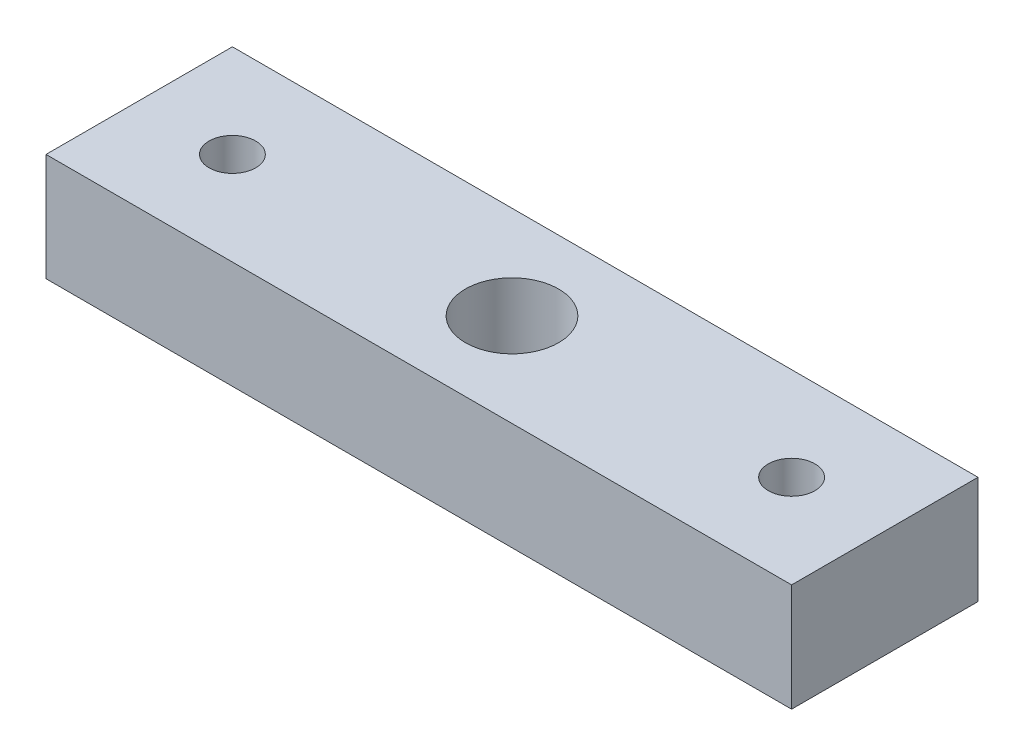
from build123d import *

# Parameters (mm, degrees)
SKETCH1_W                   = 406.4
SKETCH1_H                   = 101.6
SKETCH1_R                   = 12.7
SKETCH1_R_2                 = 25.4
BOSS_EXTRUDE1_DEPTH         = 58.684890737
F_1_4_20_TAPPED_HOLE1_D     = 5.1054
F_1_4_20_TAPPED_HOLE1_DEPTH = 31.75
F_1_4_20_TAPPED_HOLE1_TIP   = 1.533816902


with BuildPart() as part:
    # Sketch1 → Boss-Extrude1 (new body)
    with BuildSketch(Plane(origin=(0, 0, 0), x_dir=(1, 0, 0), z_dir=(0, 1, 0))):
        Rectangle(SKETCH1_W, SKETCH1_H)
        with Locations(Location((-152.4, 0, 0), (0, 0, 270))):
            Circle(SKETCH1_R, mode=Mode.SUBTRACT)
        with Locations(Location((152.4, 0, 0), (0, 0, 270))):
            Circle(SKETCH1_R, mode=Mode.SUBTRACT)
        with Locations(Location((0, 0, 0), (0, 0, 270))):
            Circle(SKETCH1_R_2, mode=Mode.SUBTRACT)
    extrude(amount=BOSS_EXTRUDE1_DEPTH)

    # 1_4-20 Tapped Hole1
    with Locations(Plane.XZ):
        with Locations((-133.35, 0), (-171.45, 0), (-152.4, 0), (133.35, 0), (171.45, 0), (152.4, 0)):
            Hole(F_1_4_20_TAPPED_HOLE1_D / 2, depth=F_1_4_20_TAPPED_HOLE1_DEPTH)
            with Locations((0, 0, -(F_1_4_20_TAPPED_HOLE1_DEPTH + F_1_4_20_TAPPED_HOLE1_TIP / 2))):  # 118° drill point
                Cone(0, F_1_4_20_TAPPED_HOLE1_D / 2, F_1_4_20_TAPPED_HOLE1_TIP, mode=Mode.SUBTRACT)


solid = part.part
